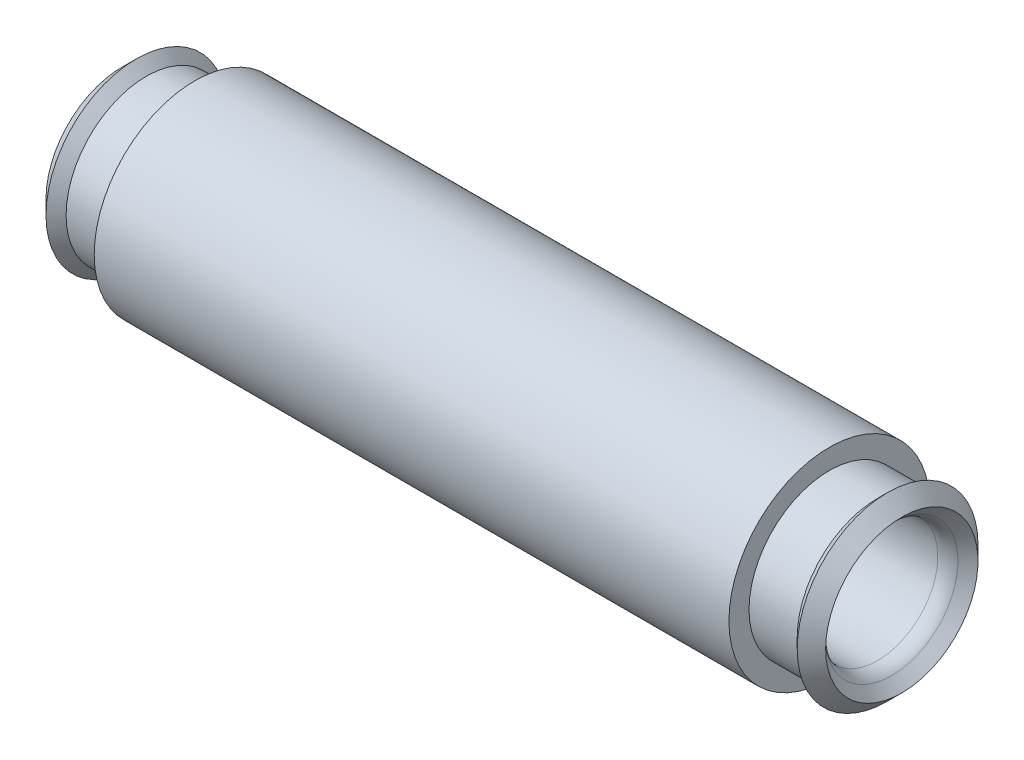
from build123d import *


with BuildPart() as part:
    # Sketch1 → Revolve1 (revolve)
    with BuildSketch(Plane.XY, mode=Mode.PRIVATE) as revolve1_sk:
        with BuildLine():
            Line((-3.95, 1.25), (3.95, 1.25))
            Line((3.95, 1.25), (3.95, 1))
            Line((3.95, 1), (4.55, 1))
            Line((4.55, 1), (4.675, 1.125))
            Line((4.675, 1.125), (4.851776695, 0.948223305))
            Line((4.851776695, 0.948223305), (4.726776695, 0.823223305))
            ThreePointArc((4.726776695, 0.823223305), (4.645670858, 0.769030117), (4.55, 0.75))
            Line((4.55, 0.75), (-4.55, 0.75))
            ThreePointArc((-4.55, 0.75), (-4.645670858, 0.769030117), (-4.726776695, 0.823223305))
            Line((-4.726776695, 0.823223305), (-4.851776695, 0.948223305))
            Line((-4.851776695, 0.948223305), (-4.675, 1.125))
            Line((-4.675, 1.125), (-4.55, 1))
            Line((-4.55, 1), (-3.95, 1))
            Line((-3.95, 1), (-3.95, 1.25))
        make_face()
    revolve(revolve1_sk.sketch.rotate(Axis((-108.445306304, 0, 0), (1, 0, 0)), 90), axis=Axis((-108.445306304, 0, 0), (1, 0, 0)))


solid = part.part
